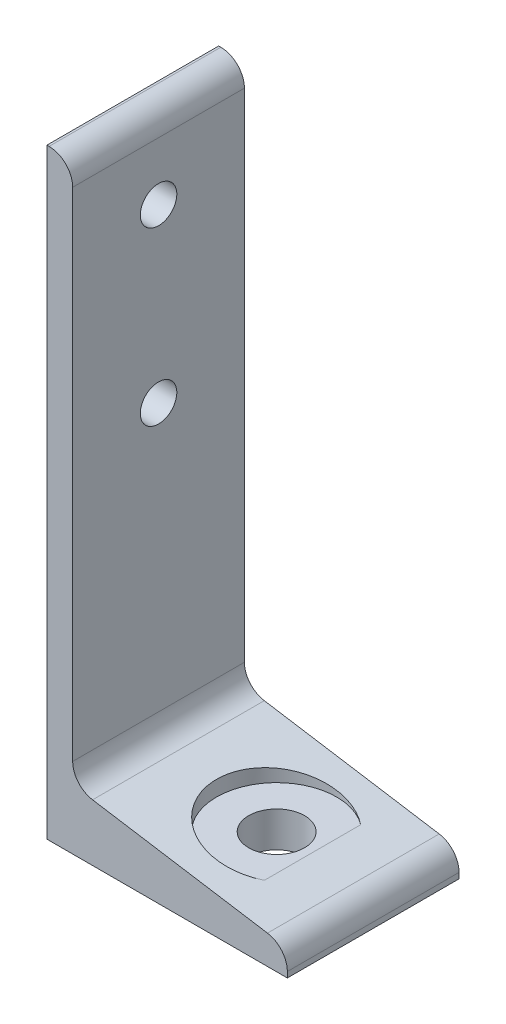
ISO-10303-21;
HEADER;
FILE_DESCRIPTION(('STEP AP214'),'2;1');
FILE_NAME('part.step','',(''),(''),'','','');
FILE_SCHEMA(('AUTOMOTIVE_DESIGN { 1 0 10303 214 1 1 1 1 }'));
ENDSEC;
DATA;
#1=APPLICATION_CONTEXT('core data for automotive mechanical design processes');
#2=APPLICATION_PROTOCOL_DEFINITION('international standard','automotive_design',2000,#1);
#3=PRODUCT_CONTEXT('',#1,'mechanical');
#4=PRODUCT('Part','Part','',(#3));
#5=PRODUCT_RELATED_PRODUCT_CATEGORY('part','',(#4));
#6=PRODUCT_DEFINITION_FORMATION('','',#4);
#7=PRODUCT_DEFINITION_CONTEXT('part definition',#1,'design');
#8=PRODUCT_DEFINITION('design','',#6,#7);
#9=PRODUCT_DEFINITION_SHAPE('','',#8);
#10=(LENGTH_UNIT() NAMED_UNIT(*) SI_UNIT(.MILLI.,.METRE.));
#11=(NAMED_UNIT(*) PLANE_ANGLE_UNIT() SI_UNIT($,.RADIAN.));
#12=(NAMED_UNIT(*) SI_UNIT($,.STERADIAN.) SOLID_ANGLE_UNIT());
#13=UNCERTAINTY_MEASURE_WITH_UNIT(LENGTH_MEASURE(1.E-05),#10,'distance_accuracy_value','');
#14=(GEOMETRIC_REPRESENTATION_CONTEXT(3) GLOBAL_UNCERTAINTY_ASSIGNED_CONTEXT((#13)) GLOBAL_UNIT_ASSIGNED_CONTEXT((#10,
#11,#12)) REPRESENTATION_CONTEXT('',''));
#15=CARTESIAN_POINT('',(0.,0.,0.));
#16=DIRECTION('',(0.,0.,1.));
#17=DIRECTION('',(1.,0.,0.));
#18=AXIS2_PLACEMENT_3D('',#15,#16,#17);
#19=CARTESIAN_POINT('',(51.3689477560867,-133.259031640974,20.));
#20=DIRECTION('',(-0.157990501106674,-0.987440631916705,0.));
#21=DIRECTION('',(0.987440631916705,-0.157990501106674,0.));
#22=AXIS2_PLACEMENT_3D('',#19,#20,#21);
#23=PLANE('',#22);
#24=DIRECTION('',(-0.987440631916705,0.157990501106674,0.));
#25=VECTOR('',#24,1.);
#26=CARTESIAN_POINT('',(51.3689477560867,-133.259031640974,-20.));
#27=LINE('',#26,#25);
#28=CARTESIAN_POINT('',(51.3689477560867,-133.259031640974,-20.));
#29=VERTEX_POINT('',#28);
#30=CARTESIAN_POINT('',(10.6310522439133,-126.740968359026,-20.));
#31=VERTEX_POINT('',#30);
#32=EDGE_CURVE('E157',#29,#31,#27,.T.);
#33=ORIENTED_EDGE('',*,*,#32,.T.);
#34=DIRECTION('',(0.,0.,-1.));
#35=VECTOR('',#34,1.);
#36=CARTESIAN_POINT('',(10.6310522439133,-126.740968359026,20.));
#37=LINE('',#36,#35);
#38=CARTESIAN_POINT('',(10.6310522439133,-126.740968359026,20.));
#39=VERTEX_POINT('',#38);
#40=EDGE_CURVE('E136',#39,#31,#37,.T.);
#41=ORIENTED_EDGE('',*,*,#40,.F.);
#42=DIRECTION('',(-0.987440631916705,0.157990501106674,0.));
#43=VECTOR('',#42,1.);
#44=CARTESIAN_POINT('',(51.3689477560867,-133.259031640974,20.));
#45=LINE('',#44,#43);
#46=CARTESIAN_POINT('',(51.3689477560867,-133.259031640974,20.));
#47=VERTEX_POINT('',#46);
#48=EDGE_CURVE('E124',#47,#39,#45,.T.);
#49=ORIENTED_EDGE('',*,*,#48,.F.);
#50=DIRECTION('',(0.,0.,-1.));
#51=VECTOR('',#50,1.);
#52=CARTESIAN_POINT('',(51.3689477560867,-133.259031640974,20.));
#53=LINE('',#52,#51);
#54=EDGE_CURVE('E167',#47,#29,#53,.T.);
#55=ORIENTED_EDGE('',*,*,#54,.T.);
#56=EDGE_LOOP('',(#33,#41,#49,#55));
#57=FACE_BOUND('',#56,.T.);
#58=CARTESIAN_POINT('',(33.5,-130.4,0.));
#59=DIRECTION('',(-0.157990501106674,-0.987440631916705,0.));
#60=DIRECTION('',(-0.987440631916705,0.157990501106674,0.));
#61=AXIS2_PLACEMENT_3D('',#58,#59,#60);
#62=ELLIPSE('',#61,14.1780675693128,14.);
#63=CARTESIAN_POINT('',(41.8810522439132,-131.740968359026,-11.2141858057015));
#64=VERTEX_POINT('',#63);
#65=CARTESIAN_POINT('',(41.8810522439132,-131.740968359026,11.2141858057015));
#66=VERTEX_POINT('',#65);
#67=EDGE_CURVE('E11',#64,#66,#62,.F.);
#68=ORIENTED_EDGE('',*,*,#67,.F.);
#69=DIRECTION('',(0.,0.,1.));
#70=VECTOR('',#69,1.);
#71=CARTESIAN_POINT('',(41.8810522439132,-131.740968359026,20.));
#72=LINE('',#71,#70);
#73=EDGE_CURVE('E188',#64,#66,#72,.T.);
#74=ORIENTED_EDGE('',*,*,#73,.T.);
#75=EDGE_LOOP('',(#68,#74));
#76=FACE_BOUND('',#75,.T.);
#77=ADVANCED_FACE('F33',(#57,#76),#23,.F.);
#78=CARTESIAN_POINT('',(0.,0.,20.));
#79=DIRECTION('',(0.,-1.,0.));
#80=DIRECTION('',(0.,0.,-1.));
#81=AXIS2_PLACEMENT_3D('',#78,#79,#80);
#82=PLANE('',#81);
#83=DIRECTION('',(-1.,0.,0.));
#84=VECTOR('',#83,1.);
#85=CARTESIAN_POINT('',(0.,0.,-20.));
#86=LINE('',#85,#84);
#87=CARTESIAN_POINT('',(0.499999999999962,0.,-20.));
#88=VERTEX_POINT('',#87);
#89=CARTESIAN_POINT('',(0.,0.,-20.));
#90=VERTEX_POINT('',#89);
#91=EDGE_CURVE('E145',#88,#90,#86,.T.);
#92=ORIENTED_EDGE('',*,*,#91,.T.);
#93=DIRECTION('',(0.,0.,-1.));
#94=VECTOR('',#93,1.);
#95=CARTESIAN_POINT('',(0.,0.,20.));
#96=LINE('',#95,#94);
#97=CARTESIAN_POINT('',(0.,0.,20.));
#98=VERTEX_POINT('',#97);
#99=EDGE_CURVE('E41',#98,#90,#96,.T.);
#100=ORIENTED_EDGE('',*,*,#99,.F.);
#101=DIRECTION('',(-1.,0.,0.));
#102=VECTOR('',#101,1.);
#103=CARTESIAN_POINT('',(0.,0.,20.));
#104=LINE('',#103,#102);
#105=CARTESIAN_POINT('',(0.499999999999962,0.,20.));
#106=VERTEX_POINT('',#105);
#107=EDGE_CURVE('E163',#106,#98,#104,.T.);
#108=ORIENTED_EDGE('',*,*,#107,.F.);
#109=DIRECTION('',(0.,0.,-1.));
#110=VECTOR('',#109,1.);
#111=CARTESIAN_POINT('',(0.499999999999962,0.,20.));
#112=LINE('',#111,#110);
#113=EDGE_CURVE('E141',#106,#88,#112,.T.);
#114=ORIENTED_EDGE('',*,*,#113,.T.);
#115=EDGE_LOOP('',(#92,#100,#108,#114));
#116=FACE_BOUND('',#115,.T.);
#117=ADVANCED_FACE('F35',(#116),#82,.F.);
#118=CARTESIAN_POINT('',(0.,0.,20.));
#119=DIRECTION('',(1.,0.,0.));
#120=DIRECTION('',(0.,0.,-1.));
#121=AXIS2_PLACEMENT_3D('',#118,#119,#120);
#122=PLANE('',#121);
#123=CARTESIAN_POINT('',(0.,-59.,0.));
#124=DIRECTION('',(-1.,0.,0.));
#125=DIRECTION('',(0.,0.,1.));
#126=AXIS2_PLACEMENT_3D('',#123,#124,#125);
#127=CIRCLE('',#126,4.25);
#128=CARTESIAN_POINT('',(0.,-59.,4.25));
#129=VERTEX_POINT('',#128);
#130=EDGE_CURVE('E185',#129,#129,#127,.T.);
#131=ORIENTED_EDGE('',*,*,#130,.F.);
#132=EDGE_LOOP('',(#131));
#133=FACE_BOUND('',#132,.T.);
#134=CARTESIAN_POINT('',(0.,-19.,0.));
#135=DIRECTION('',(-1.,0.,0.));
#136=DIRECTION('',(0.,0.,1.));
#137=AXIS2_PLACEMENT_3D('',#134,#135,#136);
#138=CIRCLE('',#137,4.25);
#139=CARTESIAN_POINT('',(0.,-19.,4.25));
#140=VERTEX_POINT('',#139);
#141=EDGE_CURVE('E182',#140,#140,#138,.T.);
#142=ORIENTED_EDGE('',*,*,#141,.F.);
#143=EDGE_LOOP('',(#142));
#144=FACE_BOUND('',#143,.T.);
#145=DIRECTION('',(0.,-1.,0.));
#146=VECTOR('',#145,1.);
#147=CARTESIAN_POINT('',(0.,0.,-20.));
#148=LINE('',#147,#146);
#149=CARTESIAN_POINT('',(0.,-140.,-20.));
#150=VERTEX_POINT('',#149);
#151=EDGE_CURVE('E148',#90,#150,#148,.T.);
#152=ORIENTED_EDGE('',*,*,#151,.T.);
#153=DIRECTION('',(0.,0.,-1.));
#154=VECTOR('',#153,1.);
#155=CARTESIAN_POINT('',(0.,-140.,20.));
#156=LINE('',#155,#154);
#157=CARTESIAN_POINT('',(0.,-140.,20.));
#158=VERTEX_POINT('',#157);
#159=EDGE_CURVE('E176',#158,#150,#156,.T.);
#160=ORIENTED_EDGE('',*,*,#159,.F.);
#161=DIRECTION('',(0.,-1.,0.));
#162=VECTOR('',#161,1.);
#163=CARTESIAN_POINT('',(0.,0.,20.));
#164=LINE('',#163,#162);
#165=EDGE_CURVE('E100',#98,#158,#164,.T.);
#166=ORIENTED_EDGE('',*,*,#165,.F.);
#167=ORIENTED_EDGE('',*,*,#99,.T.);
#168=EDGE_LOOP('',(#152,#160,#166,#167));
#169=FACE_BOUND('',#168,.T.);
#170=ADVANCED_FACE('F230',(#133,#144,#169),#122,.F.);
#171=CARTESIAN_POINT('',(0.,-140.,20.));
#172=DIRECTION('',(0.,1.,0.));
#173=DIRECTION('',(0.,0.,1.));
#174=AXIS2_PLACEMENT_3D('',#171,#172,#173);
#175=PLANE('',#174);
#176=CARTESIAN_POINT('',(33.5,-140.,0.));
#177=DIRECTION('',(0.,-1.,0.));
#178=DIRECTION('',(0.,0.,-1.));
#179=AXIS2_PLACEMENT_3D('',#176,#177,#178);
#180=CIRCLE('',#179,6.5);
#181=CARTESIAN_POINT('',(33.5,-140.,-6.5));
#182=VERTEX_POINT('',#181);
#183=EDGE_CURVE('E192',#182,#182,#180,.T.);
#184=ORIENTED_EDGE('',*,*,#183,.F.);
#185=EDGE_LOOP('',(#184));
#186=FACE_BOUND('',#185,.T.);
#187=DIRECTION('',(1.,0.,0.));
#188=VECTOR('',#187,1.);
#189=CARTESIAN_POINT('',(0.,-140.,-20.));
#190=LINE('',#189,#188);
#191=CARTESIAN_POINT('',(56.,-140.,-20.));
#192=VERTEX_POINT('',#191);
#193=EDGE_CURVE('E151',#150,#192,#190,.T.);
#194=ORIENTED_EDGE('',*,*,#193,.T.);
#195=DIRECTION('',(0.,0.,-1.));
#196=VECTOR('',#195,1.);
#197=CARTESIAN_POINT('',(56.,-140.,20.));
#198=LINE('',#197,#196);
#199=CARTESIAN_POINT('',(56.,-140.,20.));
#200=VERTEX_POINT('',#199);
#201=EDGE_CURVE('E173',#200,#192,#198,.T.);
#202=ORIENTED_EDGE('',*,*,#201,.F.);
#203=DIRECTION('',(1.,0.,0.));
#204=VECTOR('',#203,1.);
#205=CARTESIAN_POINT('',(0.,-140.,20.));
#206=LINE('',#205,#204);
#207=EDGE_CURVE('E206',#158,#200,#206,.T.);
#208=ORIENTED_EDGE('',*,*,#207,.F.);
#209=ORIENTED_EDGE('',*,*,#159,.T.);
#210=EDGE_LOOP('',(#194,#202,#208,#209));
#211=FACE_BOUND('',#210,.T.);
#212=ADVANCED_FACE('F233',(#186,#211),#175,.F.);
#213=CARTESIAN_POINT('',(56.,-140.,20.));
#214=DIRECTION('',(-1.,0.,0.));
#215=DIRECTION('',(0.,0.,1.));
#216=AXIS2_PLACEMENT_3D('',#213,#214,#215);
#217=PLANE('',#216);
#218=DIRECTION('',(0.,1.,0.));
#219=VECTOR('',#218,1.);
#220=CARTESIAN_POINT('',(56.,-140.,-20.));
#221=LINE('',#220,#219);
#222=CARTESIAN_POINT('',(56.,-138.689955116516,-20.));
#223=VERTEX_POINT('',#222);
#224=EDGE_CURVE('E153',#192,#223,#221,.T.);
#225=ORIENTED_EDGE('',*,*,#224,.T.);
#226=DIRECTION('',(0.,0.,-1.));
#227=VECTOR('',#226,1.);
#228=CARTESIAN_POINT('',(56.,-138.689955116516,20.));
#229=LINE('',#228,#227);
#230=CARTESIAN_POINT('',(56.,-138.689955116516,20.));
#231=VERTEX_POINT('',#230);
#232=EDGE_CURVE('E170',#231,#223,#229,.T.);
#233=ORIENTED_EDGE('',*,*,#232,.F.);
#234=DIRECTION('',(0.,1.,0.));
#235=VECTOR('',#234,1.);
#236=CARTESIAN_POINT('',(56.,-140.,20.));
#237=LINE('',#236,#235);
#238=EDGE_CURVE('E208',#200,#231,#237,.T.);
#239=ORIENTED_EDGE('',*,*,#238,.F.);
#240=ORIENTED_EDGE('',*,*,#201,.T.);
#241=EDGE_LOOP('',(#225,#233,#239,#240));
#242=FACE_BOUND('',#241,.T.);
#243=ADVANCED_FACE('F236',(#242),#217,.F.);
#244=CARTESIAN_POINT('',(50.5,-138.689955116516,20.));
#245=DIRECTION('',(0.,0.,-1.));
#246=DIRECTION('',(-1.,0.,0.));
#247=AXIS2_PLACEMENT_3D('',#244,#245,#246);
#248=CYLINDRICAL_SURFACE('',#247,5.49999999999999);
#249=CARTESIAN_POINT('',(50.5,-138.689955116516,-20.));
#250=DIRECTION('',(0.,0.,1.));
#251=DIRECTION('',(1.,0.,0.));
#252=AXIS2_PLACEMENT_3D('',#249,#250,#251);
#253=CIRCLE('',#252,5.49999999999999);
#254=EDGE_CURVE('E155',#223,#29,#253,.T.);
#255=ORIENTED_EDGE('',*,*,#254,.T.);
#256=ORIENTED_EDGE('',*,*,#54,.F.);
#257=CARTESIAN_POINT('',(50.5,-138.689955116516,20.));
#258=DIRECTION('',(0.,0.,1.));
#259=DIRECTION('',(1.,0.,0.));
#260=AXIS2_PLACEMENT_3D('',#257,#258,#259);
#261=CIRCLE('',#260,5.49999999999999);
#262=EDGE_CURVE('E210',#231,#47,#261,.T.);
#263=ORIENTED_EDGE('',*,*,#262,.F.);
#264=ORIENTED_EDGE('',*,*,#232,.T.);
#265=EDGE_LOOP('',(#255,#256,#263,#264));
#266=FACE_BOUND('',#265,.T.);
#267=ADVANCED_FACE('F216',(#266),#248,.T.);
#268=CARTESIAN_POINT('',(11.5,-121.310044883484,20.));
#269=DIRECTION('',(0.,0.,-1.));
#270=DIRECTION('',(-1.,0.,0.));
#271=AXIS2_PLACEMENT_3D('',#268,#269,#270);
#272=CYLINDRICAL_SURFACE('',#271,5.49999999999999);
#273=CARTESIAN_POINT('',(11.5,-121.310044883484,-20.));
#274=DIRECTION('',(0.,0.,-1.));
#275=DIRECTION('',(-1.,0.,0.));
#276=AXIS2_PLACEMENT_3D('',#273,#274,#275);
#277=CIRCLE('',#276,5.49999999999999);
#278=CARTESIAN_POINT('',(6.00000000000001,-121.310044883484,-20.));
#279=VERTEX_POINT('',#278);
#280=EDGE_CURVE('E133',#31,#279,#277,.T.);
#281=ORIENTED_EDGE('',*,*,#280,.T.);
#282=DIRECTION('',(0.,0.,-1.));
#283=VECTOR('',#282,1.);
#284=CARTESIAN_POINT('',(6.00000000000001,-121.310044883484,20.));
#285=LINE('',#284,#283);
#286=CARTESIAN_POINT('',(6.00000000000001,-121.310044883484,20.));
#287=VERTEX_POINT('',#286);
#288=EDGE_CURVE('E130',#287,#279,#285,.T.);
#289=ORIENTED_EDGE('',*,*,#288,.F.);
#290=CARTESIAN_POINT('',(11.5,-121.310044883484,20.));
#291=DIRECTION('',(0.,0.,-1.));
#292=DIRECTION('',(-1.,0.,0.));
#293=AXIS2_PLACEMENT_3D('',#290,#291,#292);
#294=CIRCLE('',#293,5.49999999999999);
#295=EDGE_CURVE('E117',#39,#287,#294,.T.);
#296=ORIENTED_EDGE('',*,*,#295,.F.);
#297=ORIENTED_EDGE('',*,*,#40,.T.);
#298=EDGE_LOOP('',(#281,#289,#296,#297));
#299=FACE_BOUND('',#298,.T.);
#300=ADVANCED_FACE('F131',(#299),#272,.F.);
#301=CARTESIAN_POINT('',(6.,-5.50000000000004,20.));
#302=DIRECTION('',(-1.,0.,0.));
#303=DIRECTION('',(0.,0.,1.));
#304=AXIS2_PLACEMENT_3D('',#301,#302,#303);
#305=PLANE('',#304);
#306=CARTESIAN_POINT('',(6.,-59.,0.));
#307=DIRECTION('',(-1.,0.,0.));
#308=DIRECTION('',(0.,0.,1.));
#309=AXIS2_PLACEMENT_3D('',#306,#307,#308);
#310=CIRCLE('',#309,4.25);
#311=CARTESIAN_POINT('',(6.,-59.,4.25));
#312=VERTEX_POINT('',#311);
#313=EDGE_CURVE('E183',#312,#312,#310,.T.);
#314=ORIENTED_EDGE('',*,*,#313,.T.);
#315=EDGE_LOOP('',(#314));
#316=FACE_BOUND('',#315,.T.);
#317=CARTESIAN_POINT('',(6.,-19.,0.));
#318=DIRECTION('',(-1.,0.,0.));
#319=DIRECTION('',(0.,0.,1.));
#320=AXIS2_PLACEMENT_3D('',#317,#318,#319);
#321=CIRCLE('',#320,4.25);
#322=CARTESIAN_POINT('',(6.,-19.,4.25));
#323=VERTEX_POINT('',#322);
#324=EDGE_CURVE('E149',#323,#323,#321,.T.);
#325=ORIENTED_EDGE('',*,*,#324,.T.);
#326=EDGE_LOOP('',(#325));
#327=FACE_BOUND('',#326,.T.);
#328=DIRECTION('',(0.,1.,0.));
#329=VECTOR('',#328,1.);
#330=CARTESIAN_POINT('',(6.,-5.50000000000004,-20.));
#331=LINE('',#330,#329);
#332=CARTESIAN_POINT('',(6.,-5.50000000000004,-20.));
#333=VERTEX_POINT('',#332);
#334=EDGE_CURVE('E160',#279,#333,#331,.T.);
#335=ORIENTED_EDGE('',*,*,#334,.T.);
#336=DIRECTION('',(0.,0.,-1.));
#337=VECTOR('',#336,1.);
#338=CARTESIAN_POINT('',(6.,-5.50000000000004,20.));
#339=LINE('',#338,#337);
#340=CARTESIAN_POINT('',(6.,-5.50000000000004,20.));
#341=VERTEX_POINT('',#340);
#342=EDGE_CURVE('E137',#341,#333,#339,.T.);
#343=ORIENTED_EDGE('',*,*,#342,.F.);
#344=DIRECTION('',(0.,1.,0.));
#345=VECTOR('',#344,1.);
#346=CARTESIAN_POINT('',(6.,-5.50000000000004,20.));
#347=LINE('',#346,#345);
#348=EDGE_CURVE('E121',#287,#341,#347,.T.);
#349=ORIENTED_EDGE('',*,*,#348,.F.);
#350=ORIENTED_EDGE('',*,*,#288,.T.);
#351=EDGE_LOOP('',(#335,#343,#349,#350));
#352=FACE_BOUND('',#351,.T.);
#353=ADVANCED_FACE('F139',(#316,#327,#352),#305,.F.);
#354=CARTESIAN_POINT('',(0.5,-5.5,20.));
#355=DIRECTION('',(0.,0.,-1.));
#356=DIRECTION('',(-1.,0.,0.));
#357=AXIS2_PLACEMENT_3D('',#354,#355,#356);
#358=CYLINDRICAL_SURFACE('',#357,5.5);
#359=CARTESIAN_POINT('',(0.5,-5.5,-20.));
#360=DIRECTION('',(0.,0.,1.));
#361=DIRECTION('',(1.,0.,0.));
#362=AXIS2_PLACEMENT_3D('',#359,#360,#361);
#363=CIRCLE('',#362,5.5);
#364=EDGE_CURVE('E91',#333,#88,#363,.T.);
#365=ORIENTED_EDGE('',*,*,#364,.T.);
#366=ORIENTED_EDGE('',*,*,#113,.F.);
#367=CARTESIAN_POINT('',(0.5,-5.5,20.));
#368=DIRECTION('',(0.,0.,1.));
#369=DIRECTION('',(1.,0.,0.));
#370=AXIS2_PLACEMENT_3D('',#367,#368,#369);
#371=CIRCLE('',#370,5.5);
#372=EDGE_CURVE('E55',#341,#106,#371,.T.);
#373=ORIENTED_EDGE('',*,*,#372,.F.);
#374=ORIENTED_EDGE('',*,*,#342,.T.);
#375=EDGE_LOOP('',(#365,#366,#373,#374));
#376=FACE_BOUND('',#375,.T.);
#377=ADVANCED_FACE('F224',(#376),#358,.T.);
#378=CARTESIAN_POINT('',(0.5,-5.5,20.));
#379=DIRECTION('',(0.,0.,1.));
#380=DIRECTION('',(1.,0.,0.));
#381=AXIS2_PLACEMENT_3D('',#378,#379,#380);
#382=PLANE('',#381);
#383=ORIENTED_EDGE('',*,*,#107,.T.);
#384=ORIENTED_EDGE('',*,*,#165,.T.);
#385=ORIENTED_EDGE('',*,*,#207,.T.);
#386=ORIENTED_EDGE('',*,*,#238,.T.);
#387=ORIENTED_EDGE('',*,*,#262,.T.);
#388=ORIENTED_EDGE('',*,*,#48,.T.);
#389=ORIENTED_EDGE('',*,*,#295,.T.);
#390=ORIENTED_EDGE('',*,*,#348,.T.);
#391=ORIENTED_EDGE('',*,*,#372,.T.);
#392=EDGE_LOOP('',(#383,#384,#385,#386,#387,#388,#389,#390,#391));
#393=FACE_BOUND('',#392,.T.);
#394=ADVANCED_FACE('F119',(#393),#382,.T.);
#395=CARTESIAN_POINT('',(0.5,-5.5,-20.));
#396=DIRECTION('',(0.,0.,1.));
#397=DIRECTION('',(1.,0.,0.));
#398=AXIS2_PLACEMENT_3D('',#395,#396,#397);
#399=PLANE('',#398);
#400=ORIENTED_EDGE('',*,*,#91,.F.);
#401=ORIENTED_EDGE('',*,*,#364,.F.);
#402=ORIENTED_EDGE('',*,*,#334,.F.);
#403=ORIENTED_EDGE('',*,*,#280,.F.);
#404=ORIENTED_EDGE('',*,*,#32,.F.);
#405=ORIENTED_EDGE('',*,*,#254,.F.);
#406=ORIENTED_EDGE('',*,*,#224,.F.);
#407=ORIENTED_EDGE('',*,*,#193,.F.);
#408=ORIENTED_EDGE('',*,*,#151,.F.);
#409=EDGE_LOOP('',(#400,#401,#402,#403,#404,#405,#406,#407,#408));
#410=FACE_BOUND('',#409,.T.);
#411=ADVANCED_FACE('F223',(#410),#399,.F.);
#412=CARTESIAN_POINT('',(30.,-19.,0.));
#413=DIRECTION('',(-1.,0.,0.));
#414=DIRECTION('',(0.,0.,1.));
#415=AXIS2_PLACEMENT_3D('',#412,#413,#414);
#416=CYLINDRICAL_SURFACE('',#415,4.25);
#417=ORIENTED_EDGE('',*,*,#141,.T.);
#418=EDGE_LOOP('',(#417));
#419=FACE_BOUND('',#418,.T.);
#420=ORIENTED_EDGE('',*,*,#324,.F.);
#421=EDGE_LOOP('',(#420));
#422=FACE_BOUND('',#421,.T.);
#423=ADVANCED_FACE('F261',(#419,#422),#416,.F.);
#424=CARTESIAN_POINT('',(30.,-59.,0.));
#425=DIRECTION('',(-1.,0.,0.));
#426=DIRECTION('',(0.,0.,1.));
#427=AXIS2_PLACEMENT_3D('',#424,#425,#426);
#428=CYLINDRICAL_SURFACE('',#427,4.25);
#429=ORIENTED_EDGE('',*,*,#130,.T.);
#430=EDGE_LOOP('',(#429));
#431=FACE_BOUND('',#430,.T.);
#432=ORIENTED_EDGE('',*,*,#313,.F.);
#433=EDGE_LOOP('',(#432));
#434=FACE_BOUND('',#433,.T.);
#435=ADVANCED_FACE('F266',(#431,#434),#428,.F.);
#436=CARTESIAN_POINT('',(33.5,-110.,0.));
#437=DIRECTION('',(0.,-1.,0.));
#438=DIRECTION('',(0.,0.,-1.));
#439=AXIS2_PLACEMENT_3D('',#436,#437,#438);
#440=CYLINDRICAL_SURFACE('',#439,6.5);
#441=CARTESIAN_POINT('',(33.5,-131.740968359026,0.));
#442=DIRECTION('',(0.,-1.,0.));
#443=DIRECTION('',(0.,0.,-1.));
#444=AXIS2_PLACEMENT_3D('',#441,#442,#443);
#445=CIRCLE('',#444,6.5);
#446=CARTESIAN_POINT('',(33.5,-131.740968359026,-6.5));
#447=VERTEX_POINT('',#446);
#448=EDGE_CURVE('E186',#447,#447,#445,.F.);
#449=ORIENTED_EDGE('',*,*,#448,.T.);
#450=EDGE_LOOP('',(#449));
#451=FACE_BOUND('',#450,.T.);
#452=ORIENTED_EDGE('',*,*,#183,.T.);
#453=EDGE_LOOP('',(#452));
#454=FACE_BOUND('',#453,.T.);
#455=ADVANCED_FACE('F270',(#451,#454),#440,.F.);
#456=CARTESIAN_POINT('',(33.5,-131.740968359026,0.));
#457=DIRECTION('',(0.,1.,0.));
#458=DIRECTION('',(0.,0.,1.));
#459=AXIS2_PLACEMENT_3D('',#456,#457,#458);
#460=CYLINDRICAL_SURFACE('',#459,14.);
#461=ORIENTED_EDGE('',*,*,#67,.T.);
#462=CARTESIAN_POINT('',(33.5,-131.740968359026,0.));
#463=DIRECTION('',(0.,-1.,0.));
#464=DIRECTION('',(0.,0.,-1.));
#465=AXIS2_PLACEMENT_3D('',#462,#463,#464);
#466=CIRCLE('',#465,14.);
#467=EDGE_CURVE('E47',#66,#64,#466,.T.);
#468=ORIENTED_EDGE('',*,*,#467,.T.);
#469=EDGE_LOOP('',(#461,#468));
#470=FACE_BOUND('',#469,.T.);
#471=ADVANCED_FACE('F274',(#470),#460,.F.);
#472=CARTESIAN_POINT('',(33.5,-131.740968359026,0.));
#473=DIRECTION('',(0.,-1.,0.));
#474=DIRECTION('',(0.,0.,-1.));
#475=AXIS2_PLACEMENT_3D('',#472,#473,#474);
#476=PLANE('',#475);
#477=ORIENTED_EDGE('',*,*,#448,.F.);
#478=EDGE_LOOP('',(#477));
#479=FACE_BOUND('',#478,.T.);
#480=ORIENTED_EDGE('',*,*,#467,.F.);
#481=ORIENTED_EDGE('',*,*,#73,.F.);
#482=EDGE_LOOP('',(#480,#481));
#483=FACE_BOUND('',#482,.T.);
#484=ADVANCED_FACE('F277',(#479,#483),#476,.F.);
#485=CLOSED_SHELL('',(#77,#117,#170,#212,#243,#267,#300,#353,#377,#394,#411,#423,#435,#455,#471,#484));
#486=MANIFOLD_SOLID_BREP('B2',#485);
#487=ADVANCED_BREP_SHAPE_REPRESENTATION('',(#18,#486),#14);
#488=SHAPE_DEFINITION_REPRESENTATION(#9,#487);
ENDSEC;
END-ISO-10303-21;
